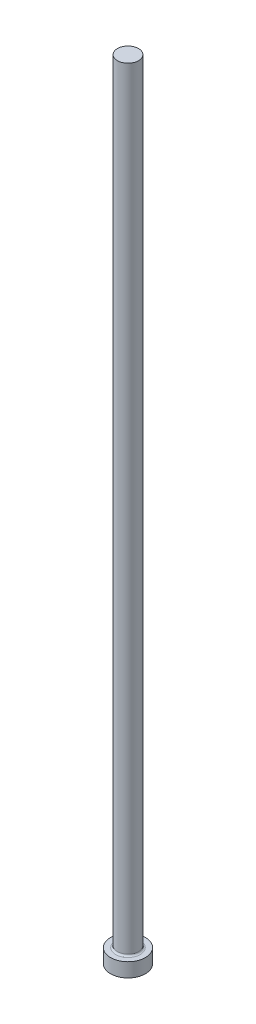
from build123d import *


with BuildPart() as part:
    # Sketch1 → Revolve1 (revolve)
    with BuildSketch(Plane.XY, mode=Mode.PRIVATE) as revolve1_sk:
        with BuildLine():
            Line((0, 0), (7.874, 0))
            Line((7.874, 0), (7.874, 6.35))
            Line((7.874, 6.35), (5.5245, 6.35))
            ThreePointArc((5.5245, 6.35), (4.985684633, 6.573184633), (4.7625, 7.112))
            Line((4.7625, 7.112), (4.7625, 355.6))
            Line((4.7625, 355.6), (0, 355.6))
            Line((0, 355.6), (0, 0))
        make_face()
    revolve(revolve1_sk.sketch.rotate(Axis((0, 355.6, 0), (0, -1, 0)), 180), axis=Axis((0, 355.6, 0), (0, -1, 0)))


solid = part.part
